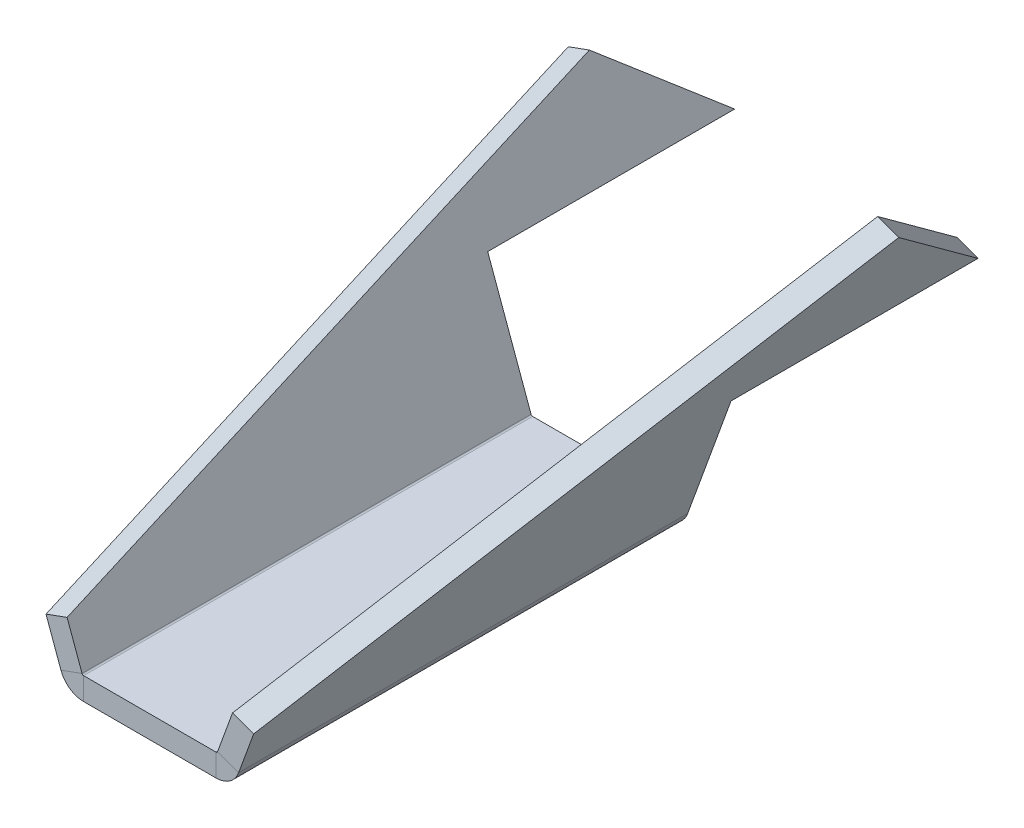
ISO-10303-21;
HEADER;
FILE_DESCRIPTION(('STEP AP214'),'2;1');
FILE_NAME('part.step','',(''),(''),'','','');
FILE_SCHEMA(('AUTOMOTIVE_DESIGN { 1 0 10303 214 1 1 1 1 }'));
ENDSEC;
DATA;
#1=APPLICATION_CONTEXT('core data for automotive mechanical design processes');
#2=APPLICATION_PROTOCOL_DEFINITION('international standard','automotive_design',2000,#1);
#3=PRODUCT_CONTEXT('',#1,'mechanical');
#4=PRODUCT('Part','Part','',(#3));
#5=PRODUCT_RELATED_PRODUCT_CATEGORY('part','',(#4));
#6=PRODUCT_DEFINITION_FORMATION('','',#4);
#7=PRODUCT_DEFINITION_CONTEXT('part definition',#1,'design');
#8=PRODUCT_DEFINITION('design','',#6,#7);
#9=PRODUCT_DEFINITION_SHAPE('','',#8);
#10=(LENGTH_UNIT() NAMED_UNIT(*) SI_UNIT(.MILLI.,.METRE.));
#11=(NAMED_UNIT(*) PLANE_ANGLE_UNIT() SI_UNIT($,.RADIAN.));
#12=(NAMED_UNIT(*) SI_UNIT($,.STERADIAN.) SOLID_ANGLE_UNIT());
#13=UNCERTAINTY_MEASURE_WITH_UNIT(LENGTH_MEASURE(1.E-05),#10,'distance_accuracy_value','');
#14=(GEOMETRIC_REPRESENTATION_CONTEXT(3) GLOBAL_UNCERTAINTY_ASSIGNED_CONTEXT((#13)) GLOBAL_UNIT_ASSIGNED_CONTEXT((#10,
#11,#12)) REPRESENTATION_CONTEXT('',''));
#15=CARTESIAN_POINT('',(0.,0.,0.));
#16=DIRECTION('',(0.,0.,1.));
#17=DIRECTION('',(1.,0.,0.));
#18=AXIS2_PLACEMENT_3D('',#15,#16,#17);
#19=CARTESIAN_POINT('',(-30.,-10.,200.));
#20=DIRECTION('',(0.,1.,0.));
#21=DIRECTION('',(0.,0.,1.));
#22=AXIS2_PLACEMENT_3D('',#19,#20,#21);
#23=PLANE('',#22);
#24=DIRECTION('',(0.,0.,-1.));
#25=VECTOR('',#24,1.);
#26=CARTESIAN_POINT('',(29.4842271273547,-10.,0.));
#27=LINE('',#26,#25);
#28=CARTESIAN_POINT('',(29.4842271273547,-10.,0.));
#29=VERTEX_POINT('',#28);
#30=CARTESIAN_POINT('',(29.4842271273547,-10.,200.));
#31=VERTEX_POINT('',#30);
#32=EDGE_CURVE('E251',#29,#31,#27,.F.);
#33=ORIENTED_EDGE('',*,*,#32,.T.);
#34=DIRECTION('',(1.,0.,0.));
#35=VECTOR('',#34,1.);
#36=CARTESIAN_POINT('',(-30.,-10.,200.));
#37=LINE('',#36,#35);
#38=CARTESIAN_POINT('',(-29.4842271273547,-10.,200.));
#39=VERTEX_POINT('',#38);
#40=EDGE_CURVE('E48',#39,#31,#37,.T.);
#41=ORIENTED_EDGE('',*,*,#40,.F.);
#42=DIRECTION('',(0.,0.,1.));
#43=VECTOR('',#42,1.);
#44=CARTESIAN_POINT('',(-29.4842271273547,-10.,200.));
#45=LINE('',#44,#43);
#46=CARTESIAN_POINT('',(-29.4842271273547,-10.,0.));
#47=VERTEX_POINT('',#46);
#48=EDGE_CURVE('E286',#39,#47,#45,.F.);
#49=ORIENTED_EDGE('',*,*,#48,.T.);
#50=DIRECTION('',(1.,0.,0.));
#51=VECTOR('',#50,1.);
#52=CARTESIAN_POINT('',(-30.,-10.,0.));
#53=LINE('',#52,#51);
#54=EDGE_CURVE('E303',#47,#29,#53,.T.);
#55=ORIENTED_EDGE('',*,*,#54,.T.);
#56=EDGE_LOOP('',(#33,#41,#49,#55));
#57=FACE_BOUND('',#56,.T.);
#58=ADVANCED_FACE('F41',(#57),#23,.F.);
#59=CARTESIAN_POINT('',(-30.,0.,200.));
#60=DIRECTION('',(0.,1.,0.));
#61=DIRECTION('',(0.,0.,1.));
#62=AXIS2_PLACEMENT_3D('',#59,#60,#61);
#63=PLANE('',#62);
#64=DIRECTION('',(1.,0.,0.));
#65=VECTOR('',#64,1.);
#66=CARTESIAN_POINT('',(-30.,0.,200.));
#67=LINE('',#66,#65);
#68=CARTESIAN_POINT('',(-29.4842271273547,0.,200.));
#69=VERTEX_POINT('',#68);
#70=CARTESIAN_POINT('',(29.4842271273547,0.,200.));
#71=VERTEX_POINT('',#70);
#72=EDGE_CURVE('E11',#69,#71,#67,.T.);
#73=ORIENTED_EDGE('',*,*,#72,.T.);
#74=DIRECTION('',(0.,0.,-1.));
#75=VECTOR('',#74,1.);
#76=CARTESIAN_POINT('',(29.4842271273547,0.,0.));
#77=LINE('',#76,#75);
#78=CARTESIAN_POINT('',(29.4842271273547,0.,0.));
#79=VERTEX_POINT('',#78);
#80=EDGE_CURVE('E263',#79,#71,#77,.F.);
#81=ORIENTED_EDGE('',*,*,#80,.F.);
#82=DIRECTION('',(1.,0.,0.));
#83=VECTOR('',#82,1.);
#84=CARTESIAN_POINT('',(-30.,0.,0.));
#85=LINE('',#84,#83);
#86=CARTESIAN_POINT('',(-29.4842271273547,0.,0.));
#87=VERTEX_POINT('',#86);
#88=EDGE_CURVE('E307',#87,#79,#85,.T.);
#89=ORIENTED_EDGE('',*,*,#88,.F.);
#90=DIRECTION('',(0.,0.,1.));
#91=VECTOR('',#90,1.);
#92=CARTESIAN_POINT('',(-29.4842271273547,0.,200.));
#93=LINE('',#92,#91);
#94=EDGE_CURVE('E54',#69,#87,#93,.F.);
#95=ORIENTED_EDGE('',*,*,#94,.F.);
#96=EDGE_LOOP('',(#73,#81,#89,#95));
#97=FACE_BOUND('',#96,.T.);
#98=ADVANCED_FACE('F355',(#97),#63,.T.);
#99=CARTESIAN_POINT('',(30.,-10.,200.));
#100=DIRECTION('',(0.,0.,-1.));
#101=DIRECTION('',(-1.,0.,0.));
#102=AXIS2_PLACEMENT_3D('',#99,#100,#101);
#103=PLANE('',#102);
#104=DIRECTION('',(0.,-1.,0.));
#105=VECTOR('',#104,1.);
#106=CARTESIAN_POINT('',(29.4842271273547,0.,200.));
#107=LINE('',#106,#105);
#108=EDGE_CURVE('E268',#71,#31,#107,.T.);
#109=ORIENTED_EDGE('',*,*,#108,.F.);
#110=ORIENTED_EDGE('',*,*,#72,.F.);
#111=DIRECTION('',(0.,-1.,0.));
#112=VECTOR('',#111,1.);
#113=CARTESIAN_POINT('',(-29.4842271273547,0.,200.));
#114=LINE('',#113,#112);
#115=EDGE_CURVE('E293',#69,#39,#114,.T.);
#116=ORIENTED_EDGE('',*,*,#115,.T.);
#117=ORIENTED_EDGE('',*,*,#40,.T.);
#118=EDGE_LOOP('',(#109,#110,#116,#117));
#119=FACE_BOUND('',#118,.T.);
#120=ADVANCED_FACE('F310',(#119),#103,.F.);
#121=CARTESIAN_POINT('',(30.,-10.,0.));
#122=DIRECTION('',(0.,0.,-1.));
#123=DIRECTION('',(-1.,0.,0.));
#124=AXIS2_PLACEMENT_3D('',#121,#122,#123);
#125=PLANE('',#124);
#126=ORIENTED_EDGE('',*,*,#88,.T.);
#127=DIRECTION('',(0.,-1.,0.));
#128=VECTOR('',#127,1.);
#129=CARTESIAN_POINT('',(29.4842271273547,0.,0.));
#130=LINE('',#129,#128);
#131=EDGE_CURVE('E257',#79,#29,#130,.T.);
#132=ORIENTED_EDGE('',*,*,#131,.T.);
#133=ORIENTED_EDGE('',*,*,#54,.F.);
#134=DIRECTION('',(0.,-1.,0.));
#135=VECTOR('',#134,1.);
#136=CARTESIAN_POINT('',(-29.4842271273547,0.,0.));
#137=LINE('',#136,#135);
#138=EDGE_CURVE('E62',#87,#47,#137,.T.);
#139=ORIENTED_EDGE('',*,*,#138,.F.);
#140=EDGE_LOOP('',(#126,#132,#133,#139));
#141=FACE_BOUND('',#140,.T.);
#142=ADVANCED_FACE('F354',(#141),#125,.T.);
#143=CARTESIAN_POINT('',(-29.4842271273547,0.736599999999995,0.));
#144=DIRECTION('',(0.,0.,-1.));
#145=DIRECTION('',(-1.,0.,0.));
#146=AXIS2_PLACEMENT_3D('',#143,#144,#145);
#147=PLANE('',#146);
#148=DIRECTION('',(-0.939692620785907,-0.342020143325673,0.));
#149=VECTOR('',#148,1.);
#150=CARTESIAN_POINT('',(-30.1764047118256,0.484667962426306,0.));
#151=LINE('',#150,#149);
#152=CARTESIAN_POINT('',(-30.1764047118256,0.484667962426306,0.));
#153=VERTEX_POINT('',#152);
#154=CARTESIAN_POINT('',(-39.5733309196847,-2.93553347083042,0.));
#155=VERTEX_POINT('',#154);
#156=EDGE_CURVE('E271',#153,#155,#151,.T.);
#157=ORIENTED_EDGE('',*,*,#156,.F.);
#158=CARTESIAN_POINT('',(-29.4842271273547,0.736599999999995,0.));
#159=DIRECTION('',(0.,0.,1.));
#160=DIRECTION('',(1.,0.,0.));
#161=AXIS2_PLACEMENT_3D('',#158,#159,#160);
#162=CIRCLE('',#161,0.736599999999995);
#163=EDGE_CURVE('E296',#87,#153,#162,.F.);
#164=ORIENTED_EDGE('',*,*,#163,.F.);
#165=ORIENTED_EDGE('',*,*,#138,.T.);
#166=CARTESIAN_POINT('',(-29.4842271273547,0.736599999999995,0.));
#167=DIRECTION('',(0.,0.,1.));
#168=DIRECTION('',(1.,0.,0.));
#169=AXIS2_PLACEMENT_3D('',#166,#167,#168);
#170=CIRCLE('',#169,10.7366);
#171=EDGE_CURVE('E289',#47,#155,#170,.F.);
#172=ORIENTED_EDGE('',*,*,#171,.T.);
#173=EDGE_LOOP('',(#157,#164,#165,#172));
#174=FACE_BOUND('',#173,.T.);
#175=ADVANCED_FACE('F361',(#174),#147,.T.);
#176=CARTESIAN_POINT('',(-29.4842271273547,0.736599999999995,200.));
#177=DIRECTION('',(0.,0.,-1.));
#178=DIRECTION('',(-1.,0.,0.));
#179=AXIS2_PLACEMENT_3D('',#176,#177,#178);
#180=PLANE('',#179);
#181=CARTESIAN_POINT('',(-29.4842271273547,0.736599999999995,200.));
#182=DIRECTION('',(0.,0.,1.));
#183=DIRECTION('',(1.,0.,0.));
#184=AXIS2_PLACEMENT_3D('',#181,#182,#183);
#185=CIRCLE('',#184,0.736599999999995);
#186=CARTESIAN_POINT('',(-30.1764047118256,0.484667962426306,200.));
#187=VERTEX_POINT('',#186);
#188=EDGE_CURVE('E175',#187,#69,#185,.T.);
#189=ORIENTED_EDGE('',*,*,#188,.F.);
#190=DIRECTION('',(-0.939692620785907,-0.342020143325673,0.));
#191=VECTOR('',#190,1.);
#192=CARTESIAN_POINT('',(-30.1764047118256,0.484667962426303,200.));
#193=LINE('',#192,#191);
#194=CARTESIAN_POINT('',(-39.5733309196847,-2.93553347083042,200.));
#195=VERTEX_POINT('',#194);
#196=EDGE_CURVE('E162',#187,#195,#193,.T.);
#197=ORIENTED_EDGE('',*,*,#196,.T.);
#198=CARTESIAN_POINT('',(-29.4842271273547,0.736599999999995,200.));
#199=DIRECTION('',(0.,0.,1.));
#200=DIRECTION('',(1.,0.,0.));
#201=AXIS2_PLACEMENT_3D('',#198,#199,#200);
#202=CIRCLE('',#201,10.7366);
#203=EDGE_CURVE('E290',#195,#39,#202,.T.);
#204=ORIENTED_EDGE('',*,*,#203,.T.);
#205=ORIENTED_EDGE('',*,*,#115,.F.);
#206=EDGE_LOOP('',(#189,#197,#204,#205));
#207=FACE_BOUND('',#206,.T.);
#208=ADVANCED_FACE('F390',(#207),#180,.F.);
#209=CARTESIAN_POINT('',(-29.4842271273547,0.736599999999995,200.));
#210=DIRECTION('',(0.,0.,1.));
#211=DIRECTION('',(-0.939692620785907,-0.342020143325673,0.));
#212=AXIS2_PLACEMENT_3D('',#209,#210,#211);
#213=CYLINDRICAL_SURFACE('',#212,10.7366);
#214=ORIENTED_EDGE('',*,*,#48,.F.);
#215=ORIENTED_EDGE('',*,*,#203,.F.);
#216=DIRECTION('',(0.,0.,-1.));
#217=VECTOR('',#216,1.);
#218=CARTESIAN_POINT('',(-39.5733309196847,-2.93553347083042,0.));
#219=LINE('',#218,#217);
#220=EDGE_CURVE('E167',#195,#155,#219,.T.);
#221=ORIENTED_EDGE('',*,*,#220,.T.);
#222=ORIENTED_EDGE('',*,*,#171,.F.);
#223=EDGE_LOOP('',(#214,#215,#221,#222));
#224=FACE_BOUND('',#223,.T.);
#225=ADVANCED_FACE('F388',(#224),#213,.T.);
#226=CARTESIAN_POINT('',(-29.4842271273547,0.736599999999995,200.));
#227=DIRECTION('',(0.,0.,1.));
#228=DIRECTION('',(-0.939692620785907,-0.342020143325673,0.));
#229=AXIS2_PLACEMENT_3D('',#226,#227,#228);
#230=CYLINDRICAL_SURFACE('',#229,0.736599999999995);
#231=ORIENTED_EDGE('',*,*,#94,.T.);
#232=ORIENTED_EDGE('',*,*,#163,.T.);
#233=DIRECTION('',(0.,0.,1.));
#234=VECTOR('',#233,1.);
#235=CARTESIAN_POINT('',(-30.1764047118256,0.484667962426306,0.));
#236=LINE('',#235,#234);
#237=EDGE_CURVE('E274',#153,#187,#236,.T.);
#238=ORIENTED_EDGE('',*,*,#237,.T.);
#239=ORIENTED_EDGE('',*,*,#188,.T.);
#240=EDGE_LOOP('',(#231,#232,#238,#239));
#241=FACE_BOUND('',#240,.T.);
#242=ADVANCED_FACE('F358',(#241),#230,.F.);
#243=CARTESIAN_POINT('',(-46.2373290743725,15.3736509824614,200.));
#244=DIRECTION('',(0.,0.,-1.));
#245=DIRECTION('',(-1.,0.,0.));
#246=AXIS2_PLACEMENT_3D('',#243,#244,#245);
#247=PLANE('',#246);
#248=ORIENTED_EDGE('',*,*,#196,.F.);
#249=DIRECTION('',(-0.342020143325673,0.939692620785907,0.));
#250=VECTOR('',#249,1.);
#251=CARTESIAN_POINT('',(-36.8404028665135,18.7938524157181,200.));
#252=LINE('',#251,#250);
#253=CARTESIAN_POINT('',(-36.8404028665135,18.7938524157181,200.));
#254=VERTEX_POINT('',#253);
#255=EDGE_CURVE('E155',#187,#254,#252,.T.);
#256=ORIENTED_EDGE('',*,*,#255,.T.);
#257=DIRECTION('',(0.939692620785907,0.342020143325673,0.));
#258=VECTOR('',#257,1.);
#259=CARTESIAN_POINT('',(-46.2373290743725,15.3736509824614,200.));
#260=LINE('',#259,#258);
#261=CARTESIAN_POINT('',(-46.2373290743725,15.3736509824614,200.));
#262=VERTEX_POINT('',#261);
#263=EDGE_CURVE('E159',#262,#254,#260,.T.);
#264=ORIENTED_EDGE('',*,*,#263,.F.);
#265=DIRECTION('',(-0.342020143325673,0.939692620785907,0.));
#266=VECTOR('',#265,1.);
#267=CARTESIAN_POINT('',(-46.2373290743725,15.3736509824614,200.));
#268=LINE('',#267,#266);
#269=EDGE_CURVE('E280',#195,#262,#268,.T.);
#270=ORIENTED_EDGE('',*,*,#269,.F.);
#271=EDGE_LOOP('',(#248,#256,#264,#270));
#272=FACE_BOUND('',#271,.T.);
#273=ADVANCED_FACE('F157',(#272),#247,.F.);
#274=CARTESIAN_POINT('',(-39.3969262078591,-3.42020143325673,0.));
#275=DIRECTION('',(0.,0.,1.));
#276=DIRECTION('',(1.,0.,0.));
#277=AXIS2_PLACEMENT_3D('',#274,#275,#276);
#278=PLANE('',#277);
#279=ORIENTED_EDGE('',*,*,#156,.T.);
#280=DIRECTION('',(0.342020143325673,-0.939692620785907,0.));
#281=VECTOR('',#280,1.);
#282=CARTESIAN_POINT('',(-39.3969262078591,-3.42020143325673,0.));
#283=LINE('',#282,#281);
#284=CARTESIAN_POINT('',(-58.8920743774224,50.14227795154,0.));
#285=VERTEX_POINT('',#284);
#286=EDGE_CURVE('E176',#285,#155,#283,.T.);
#287=ORIENTED_EDGE('',*,*,#286,.F.);
#288=DIRECTION('',(-0.939692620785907,-0.342020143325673,0.));
#289=VECTOR('',#288,1.);
#290=CARTESIAN_POINT('',(-49.4951481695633,53.5624793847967,0.));
#291=LINE('',#290,#289);
#292=CARTESIAN_POINT('',(-49.4951481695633,53.5624793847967,0.));
#293=VERTEX_POINT('',#292);
#294=EDGE_CURVE('E197',#293,#285,#291,.T.);
#295=ORIENTED_EDGE('',*,*,#294,.F.);
#296=DIRECTION('',(0.342020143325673,-0.939692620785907,0.));
#297=VECTOR('',#296,1.);
#298=CARTESIAN_POINT('',(-30.,0.,0.));
#299=LINE('',#298,#297);
#300=EDGE_CURVE('E166',#293,#153,#299,.T.);
#301=ORIENTED_EDGE('',*,*,#300,.T.);
#302=EDGE_LOOP('',(#279,#287,#295,#301));
#303=FACE_BOUND('',#302,.T.);
#304=ADVANCED_FACE('F364',(#303),#278,.F.);
#305=CARTESIAN_POINT('',(-39.3969262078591,-3.42020143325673,0.));
#306=DIRECTION('',(0.939692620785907,0.342020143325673,0.));
#307=DIRECTION('',(-0.342020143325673,0.939692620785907,0.));
#308=AXIS2_PLACEMENT_3D('',#305,#306,#307);
#309=PLANE('',#308);
#310=ORIENTED_EDGE('',*,*,#220,.F.);
#311=ORIENTED_EDGE('',*,*,#269,.T.);
#312=DIRECTION('',(-0.100583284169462,0.27635030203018,-0.95577900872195));
#313=VECTOR('',#312,1.);
#314=CARTESIAN_POINT('',(-46.2373290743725,15.3736509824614,200.));
#315=LINE('',#314,#313);
#316=CARTESIAN_POINT('',(-73.5989405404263,90.549060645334,-60.));
#317=VERTEX_POINT('',#316);
#318=EDGE_CURVE('E174',#262,#317,#315,.T.);
#319=ORIENTED_EDGE('',*,*,#318,.T.);
#320=DIRECTION('',(0.223010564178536,-0.612716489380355,-0.758185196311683));
#321=VECTOR('',#320,1.);
#322=CARTESIAN_POINT('',(-73.5989405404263,90.549060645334,-60.));
#323=LINE('',#322,#321);
#324=CARTESIAN_POINT('',(-58.8920743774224,50.14227795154,-110.));
#325=VERTEX_POINT('',#324);
#326=EDGE_CURVE('E188',#317,#325,#323,.T.);
#327=ORIENTED_EDGE('',*,*,#326,.T.);
#328=DIRECTION('',(0.,0.,1.));
#329=VECTOR('',#328,1.);
#330=CARTESIAN_POINT('',(-58.8920743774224,50.14227795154,-110.));
#331=LINE('',#330,#329);
#332=EDGE_CURVE('E183',#325,#285,#331,.T.);
#333=ORIENTED_EDGE('',*,*,#332,.T.);
#334=ORIENTED_EDGE('',*,*,#286,.T.);
#335=EDGE_LOOP('',(#310,#311,#319,#327,#333,#334));
#336=FACE_BOUND('',#335,.T.);
#337=ADVANCED_FACE('F368',(#336),#309,.F.);
#338=CARTESIAN_POINT('',(-30.,0.,0.));
#339=DIRECTION('',(0.939692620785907,0.342020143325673,0.));
#340=DIRECTION('',(-0.342020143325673,0.939692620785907,0.));
#341=AXIS2_PLACEMENT_3D('',#338,#339,#340);
#342=PLANE('',#341);
#343=ORIENTED_EDGE('',*,*,#255,.F.);
#344=ORIENTED_EDGE('',*,*,#237,.F.);
#345=ORIENTED_EDGE('',*,*,#300,.F.);
#346=DIRECTION('',(0.,0.,1.));
#347=VECTOR('',#346,1.);
#348=CARTESIAN_POINT('',(-49.4951481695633,53.5624793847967,-110.));
#349=LINE('',#348,#347);
#350=CARTESIAN_POINT('',(-49.4951481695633,53.5624793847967,-110.));
#351=VERTEX_POINT('',#350);
#352=EDGE_CURVE('E185',#351,#293,#349,.T.);
#353=ORIENTED_EDGE('',*,*,#352,.F.);
#354=DIRECTION('',(0.223010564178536,-0.612716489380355,-0.758185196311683));
#355=VECTOR('',#354,1.);
#356=CARTESIAN_POINT('',(-64.2020143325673,93.9692620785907,-60.));
#357=LINE('',#356,#355);
#358=CARTESIAN_POINT('',(-64.2020143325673,93.9692620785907,-60.));
#359=VERTEX_POINT('',#358);
#360=EDGE_CURVE('E182',#359,#351,#357,.T.);
#361=ORIENTED_EDGE('',*,*,#360,.F.);
#362=DIRECTION('',(-0.100583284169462,0.27635030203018,-0.95577900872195));
#363=VECTOR('',#362,1.);
#364=CARTESIAN_POINT('',(-36.8404028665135,18.7938524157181,200.));
#365=LINE('',#364,#363);
#366=EDGE_CURVE('E172',#254,#359,#365,.T.);
#367=ORIENTED_EDGE('',*,*,#366,.F.);
#368=EDGE_LOOP('',(#343,#344,#345,#353,#361,#367));
#369=FACE_BOUND('',#368,.T.);
#370=ADVANCED_FACE('F179',(#369),#342,.T.);
#371=CARTESIAN_POINT('',(29.4842271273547,0.736599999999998,200.));
#372=DIRECTION('',(0.,0.,1.));
#373=DIRECTION('',(1.,0.,0.));
#374=AXIS2_PLACEMENT_3D('',#371,#372,#373);
#375=PLANE('',#374);
#376=DIRECTION('',(0.939692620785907,-0.342020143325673,0.));
#377=VECTOR('',#376,1.);
#378=CARTESIAN_POINT('',(30.1764047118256,0.484667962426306,200.));
#379=LINE('',#378,#377);
#380=CARTESIAN_POINT('',(30.1764047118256,0.484667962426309,200.));
#381=VERTEX_POINT('',#380);
#382=CARTESIAN_POINT('',(39.5733309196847,-2.93553347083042,200.));
#383=VERTEX_POINT('',#382);
#384=EDGE_CURVE('E224',#381,#383,#379,.T.);
#385=ORIENTED_EDGE('',*,*,#384,.F.);
#386=CARTESIAN_POINT('',(29.4842271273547,0.736599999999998,200.));
#387=DIRECTION('',(0.,0.,-1.));
#388=DIRECTION('',(-1.,0.,0.));
#389=AXIS2_PLACEMENT_3D('',#386,#387,#388);
#390=CIRCLE('',#389,0.736599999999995);
#391=EDGE_CURVE('E260',#71,#381,#390,.F.);
#392=ORIENTED_EDGE('',*,*,#391,.F.);
#393=ORIENTED_EDGE('',*,*,#108,.T.);
#394=CARTESIAN_POINT('',(29.4842271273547,0.736599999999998,200.));
#395=DIRECTION('',(0.,0.,-1.));
#396=DIRECTION('',(-1.,0.,0.));
#397=AXIS2_PLACEMENT_3D('',#394,#395,#396);
#398=CIRCLE('',#397,10.7366);
#399=EDGE_CURVE('E253',#31,#383,#398,.F.);
#400=ORIENTED_EDGE('',*,*,#399,.T.);
#401=EDGE_LOOP('',(#385,#392,#393,#400));
#402=FACE_BOUND('',#401,.T.);
#403=ADVANCED_FACE('F317',(#402),#375,.T.);
#404=CARTESIAN_POINT('',(29.4842271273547,0.736599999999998,0.));
#405=DIRECTION('',(0.,0.,1.));
#406=DIRECTION('',(1.,0.,0.));
#407=AXIS2_PLACEMENT_3D('',#404,#405,#406);
#408=PLANE('',#407);
#409=CARTESIAN_POINT('',(29.4842271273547,0.736599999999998,0.));
#410=DIRECTION('',(0.,0.,-1.));
#411=DIRECTION('',(-1.,0.,0.));
#412=AXIS2_PLACEMENT_3D('',#409,#410,#411);
#413=CIRCLE('',#412,0.736599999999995);
#414=CARTESIAN_POINT('',(30.1764047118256,0.484667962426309,0.));
#415=VERTEX_POINT('',#414);
#416=EDGE_CURVE('E250',#415,#79,#413,.T.);
#417=ORIENTED_EDGE('',*,*,#416,.F.);
#418=DIRECTION('',(0.939692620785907,-0.342020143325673,0.));
#419=VECTOR('',#418,1.);
#420=CARTESIAN_POINT('',(30.1764047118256,0.48466796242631,0.));
#421=LINE('',#420,#419);
#422=CARTESIAN_POINT('',(39.5733309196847,-2.93553347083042,0.));
#423=VERTEX_POINT('',#422);
#424=EDGE_CURVE('E231',#415,#423,#421,.T.);
#425=ORIENTED_EDGE('',*,*,#424,.T.);
#426=CARTESIAN_POINT('',(29.4842271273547,0.736599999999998,0.));
#427=DIRECTION('',(0.,0.,-1.));
#428=DIRECTION('',(-1.,0.,0.));
#429=AXIS2_PLACEMENT_3D('',#426,#427,#428);
#430=CIRCLE('',#429,10.7366);
#431=EDGE_CURVE('E254',#423,#29,#430,.T.);
#432=ORIENTED_EDGE('',*,*,#431,.T.);
#433=ORIENTED_EDGE('',*,*,#131,.F.);
#434=EDGE_LOOP('',(#417,#425,#432,#433));
#435=FACE_BOUND('',#434,.T.);
#436=ADVANCED_FACE('F353',(#435),#408,.F.);
#437=CARTESIAN_POINT('',(29.4842271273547,0.736599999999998,0.));
#438=DIRECTION('',(0.,0.,-1.));
#439=DIRECTION('',(0.939692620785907,-0.342020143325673,0.));
#440=AXIS2_PLACEMENT_3D('',#437,#438,#439);
#441=CYLINDRICAL_SURFACE('',#440,10.7366);
#442=ORIENTED_EDGE('',*,*,#32,.F.);
#443=ORIENTED_EDGE('',*,*,#431,.F.);
#444=DIRECTION('',(0.,0.,1.));
#445=VECTOR('',#444,1.);
#446=CARTESIAN_POINT('',(39.5733309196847,-2.93553347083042,200.));
#447=LINE('',#446,#445);
#448=EDGE_CURVE('E234',#423,#383,#447,.T.);
#449=ORIENTED_EDGE('',*,*,#448,.T.);
#450=ORIENTED_EDGE('',*,*,#399,.F.);
#451=EDGE_LOOP('',(#442,#443,#449,#450));
#452=FACE_BOUND('',#451,.T.);
#453=ADVANCED_FACE('F320',(#452),#441,.T.);
#454=CARTESIAN_POINT('',(29.4842271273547,0.736599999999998,0.));
#455=DIRECTION('',(0.,0.,-1.));
#456=DIRECTION('',(0.939692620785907,-0.342020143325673,0.));
#457=AXIS2_PLACEMENT_3D('',#454,#455,#456);
#458=CYLINDRICAL_SURFACE('',#457,0.736599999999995);
#459=ORIENTED_EDGE('',*,*,#80,.T.);
#460=ORIENTED_EDGE('',*,*,#391,.T.);
#461=DIRECTION('',(0.,0.,-1.));
#462=VECTOR('',#461,1.);
#463=CARTESIAN_POINT('',(30.1764047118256,0.484667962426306,200.));
#464=LINE('',#463,#462);
#465=EDGE_CURVE('E229',#381,#415,#464,.T.);
#466=ORIENTED_EDGE('',*,*,#465,.T.);
#467=ORIENTED_EDGE('',*,*,#416,.T.);
#468=EDGE_LOOP('',(#459,#460,#466,#467));
#469=FACE_BOUND('',#468,.T.);
#470=ADVANCED_FACE('F350',(#469),#458,.F.);
#471=CARTESIAN_POINT('',(39.3969262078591,-3.42020143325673,200.));
#472=DIRECTION('',(0.,0.,-1.));
#473=DIRECTION('',(-1.,0.,0.));
#474=AXIS2_PLACEMENT_3D('',#471,#472,#473);
#475=PLANE('',#474);
#476=ORIENTED_EDGE('',*,*,#384,.T.);
#477=DIRECTION('',(-0.342020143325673,-0.939692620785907,0.));
#478=VECTOR('',#477,1.);
#479=CARTESIAN_POINT('',(39.3969262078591,-3.42020143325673,200.));
#480=LINE('',#479,#478);
#481=CARTESIAN_POINT('',(46.2373290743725,15.3736509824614,200.));
#482=VERTEX_POINT('',#481);
#483=EDGE_CURVE('E239',#482,#383,#480,.T.);
#484=ORIENTED_EDGE('',*,*,#483,.F.);
#485=DIRECTION('',(-0.939692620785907,0.342020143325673,0.));
#486=VECTOR('',#485,1.);
#487=CARTESIAN_POINT('',(46.2373290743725,15.3736509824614,200.));
#488=LINE('',#487,#486);
#489=CARTESIAN_POINT('',(36.8404028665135,18.7938524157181,200.));
#490=VERTEX_POINT('',#489);
#491=EDGE_CURVE('E245',#482,#490,#488,.T.);
#492=ORIENTED_EDGE('',*,*,#491,.T.);
#493=DIRECTION('',(-0.342020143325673,-0.939692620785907,0.));
#494=VECTOR('',#493,1.);
#495=CARTESIAN_POINT('',(30.,0.,200.));
#496=LINE('',#495,#494);
#497=EDGE_CURVE('E238',#490,#381,#496,.T.);
#498=ORIENTED_EDGE('',*,*,#497,.T.);
#499=EDGE_LOOP('',(#476,#484,#492,#498));
#500=FACE_BOUND('',#499,.T.);
#501=ADVANCED_FACE('F343',(#500),#475,.F.);
#502=CARTESIAN_POINT('',(46.2373290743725,15.3736509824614,0.));
#503=DIRECTION('',(0.,0.,1.));
#504=DIRECTION('',(1.,0.,0.));
#505=AXIS2_PLACEMENT_3D('',#502,#503,#504);
#506=PLANE('',#505);
#507=ORIENTED_EDGE('',*,*,#424,.F.);
#508=DIRECTION('',(0.342020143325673,0.939692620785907,0.));
#509=VECTOR('',#508,1.);
#510=CARTESIAN_POINT('',(36.8404028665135,18.7938524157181,0.));
#511=LINE('',#510,#509);
#512=CARTESIAN_POINT('',(49.4951481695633,53.5624793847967,0.));
#513=VERTEX_POINT('',#512);
#514=EDGE_CURVE('E243',#415,#513,#511,.T.);
#515=ORIENTED_EDGE('',*,*,#514,.T.);
#516=DIRECTION('',(0.939692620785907,-0.342020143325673,0.));
#517=VECTOR('',#516,1.);
#518=CARTESIAN_POINT('',(49.4951481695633,53.5624793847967,0.));
#519=LINE('',#518,#517);
#520=CARTESIAN_POINT('',(58.8920743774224,50.14227795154,0.));
#521=VERTEX_POINT('',#520);
#522=EDGE_CURVE('E214',#513,#521,#519,.T.);
#523=ORIENTED_EDGE('',*,*,#522,.T.);
#524=DIRECTION('',(0.342020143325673,0.939692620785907,0.));
#525=VECTOR('',#524,1.);
#526=CARTESIAN_POINT('',(46.2373290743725,15.3736509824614,0.));
#527=LINE('',#526,#525);
#528=EDGE_CURVE('E242',#423,#521,#527,.T.);
#529=ORIENTED_EDGE('',*,*,#528,.F.);
#530=EDGE_LOOP('',(#507,#515,#523,#529));
#531=FACE_BOUND('',#530,.T.);
#532=ADVANCED_FACE('F327',(#531),#506,.F.);
#533=CARTESIAN_POINT('',(46.2373290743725,15.3736509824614,200.));
#534=DIRECTION('',(-0.939692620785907,0.342020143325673,0.));
#535=DIRECTION('',(-0.342020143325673,-0.939692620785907,0.));
#536=AXIS2_PLACEMENT_3D('',#533,#534,#535);
#537=PLANE('',#536);
#538=ORIENTED_EDGE('',*,*,#448,.F.);
#539=ORIENTED_EDGE('',*,*,#528,.T.);
#540=DIRECTION('',(0.,0.,-1.));
#541=VECTOR('',#540,1.);
#542=CARTESIAN_POINT('',(58.8920743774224,50.14227795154,0.));
#543=LINE('',#542,#541);
#544=CARTESIAN_POINT('',(58.8920743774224,50.14227795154,-110.));
#545=VERTEX_POINT('',#544);
#546=EDGE_CURVE('E200',#521,#545,#543,.T.);
#547=ORIENTED_EDGE('',*,*,#546,.T.);
#548=DIRECTION('',(0.223010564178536,0.612716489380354,0.758185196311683));
#549=VECTOR('',#548,1.);
#550=CARTESIAN_POINT('',(73.5989405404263,90.549060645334,-60.));
#551=LINE('',#550,#549);
#552=CARTESIAN_POINT('',(73.5989405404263,90.549060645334,-60.));
#553=VERTEX_POINT('',#552);
#554=EDGE_CURVE('E217',#545,#553,#551,.T.);
#555=ORIENTED_EDGE('',*,*,#554,.T.);
#556=DIRECTION('',(-0.100583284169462,-0.27635030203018,0.95577900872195));
#557=VECTOR('',#556,1.);
#558=CARTESIAN_POINT('',(46.2373290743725,15.3736509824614,200.));
#559=LINE('',#558,#557);
#560=EDGE_CURVE('E208',#553,#482,#559,.T.);
#561=ORIENTED_EDGE('',*,*,#560,.T.);
#562=ORIENTED_EDGE('',*,*,#483,.T.);
#563=EDGE_LOOP('',(#538,#539,#547,#555,#561,#562));
#564=FACE_BOUND('',#563,.T.);
#565=ADVANCED_FACE('F324',(#564),#537,.F.);
#566=CARTESIAN_POINT('',(36.8404028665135,18.7938524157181,200.));
#567=DIRECTION('',(-0.939692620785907,0.342020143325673,0.));
#568=DIRECTION('',(-0.342020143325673,-0.939692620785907,0.));
#569=AXIS2_PLACEMENT_3D('',#566,#567,#568);
#570=PLANE('',#569);
#571=ORIENTED_EDGE('',*,*,#514,.F.);
#572=ORIENTED_EDGE('',*,*,#465,.F.);
#573=ORIENTED_EDGE('',*,*,#497,.F.);
#574=DIRECTION('',(-0.100583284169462,-0.27635030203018,0.95577900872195));
#575=VECTOR('',#574,1.);
#576=CARTESIAN_POINT('',(36.8404028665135,18.7938524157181,200.));
#577=LINE('',#576,#575);
#578=CARTESIAN_POINT('',(64.2020143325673,93.9692620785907,-60.));
#579=VERTEX_POINT('',#578);
#580=EDGE_CURVE('E211',#579,#490,#577,.T.);
#581=ORIENTED_EDGE('',*,*,#580,.F.);
#582=DIRECTION('',(0.223010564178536,0.612716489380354,0.758185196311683));
#583=VECTOR('',#582,1.);
#584=CARTESIAN_POINT('',(64.2020143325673,93.9692620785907,-60.));
#585=LINE('',#584,#583);
#586=CARTESIAN_POINT('',(49.4951481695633,53.5624793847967,-110.));
#587=VERTEX_POINT('',#586);
#588=EDGE_CURVE('E207',#587,#579,#585,.T.);
#589=ORIENTED_EDGE('',*,*,#588,.F.);
#590=DIRECTION('',(0.,0.,-1.));
#591=VECTOR('',#590,1.);
#592=CARTESIAN_POINT('',(49.4951481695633,53.5624793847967,0.));
#593=LINE('',#592,#591);
#594=EDGE_CURVE('E204',#513,#587,#593,.T.);
#595=ORIENTED_EDGE('',*,*,#594,.F.);
#596=EDGE_LOOP('',(#571,#572,#573,#581,#589,#595));
#597=FACE_BOUND('',#596,.T.);
#598=ADVANCED_FACE('F346',(#597),#570,.T.);
#599=CARTESIAN_POINT('',(36.8404028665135,18.7938524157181,200.));
#600=DIRECTION('',(0.326895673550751,0.898138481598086,0.294085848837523));
#601=DIRECTION('',(-0.939692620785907,0.342020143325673,0.));
#602=AXIS2_PLACEMENT_3D('',#599,#600,#601);
#603=PLANE('',#602);
#604=ORIENTED_EDGE('',*,*,#560,.F.);
#605=DIRECTION('',(0.939692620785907,-0.342020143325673,0.));
#606=VECTOR('',#605,1.);
#607=CARTESIAN_POINT('',(64.2020143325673,93.9692620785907,-60.));
#608=LINE('',#607,#606);
#609=EDGE_CURVE('E222',#579,#553,#608,.T.);
#610=ORIENTED_EDGE('',*,*,#609,.F.);
#611=ORIENTED_EDGE('',*,*,#580,.T.);
#612=ORIENTED_EDGE('',*,*,#491,.F.);
#613=EDGE_LOOP('',(#604,#610,#611,#612));
#614=FACE_BOUND('',#613,.T.);
#615=ADVANCED_FACE('F339',(#614),#603,.T.);
#616=CARTESIAN_POINT('',(64.2020143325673,93.9692620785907,-60.));
#617=DIRECTION('',(0.259314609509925,0.712461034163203,-0.652039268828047));
#618=DIRECTION('',(0.,0.675133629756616,0.737695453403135));
#619=AXIS2_PLACEMENT_3D('',#616,#617,#618);
#620=PLANE('',#619);
#621=ORIENTED_EDGE('',*,*,#554,.F.);
#622=DIRECTION('',(0.939692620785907,-0.342020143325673,0.));
#623=VECTOR('',#622,1.);
#624=CARTESIAN_POINT('',(49.4951481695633,53.5624793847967,-110.));
#625=LINE('',#624,#623);
#626=EDGE_CURVE('E225',#587,#545,#625,.T.);
#627=ORIENTED_EDGE('',*,*,#626,.F.);
#628=ORIENTED_EDGE('',*,*,#588,.T.);
#629=ORIENTED_EDGE('',*,*,#609,.T.);
#630=EDGE_LOOP('',(#621,#627,#628,#629));
#631=FACE_BOUND('',#630,.T.);
#632=ADVANCED_FACE('F431',(#631),#620,.T.);
#633=CARTESIAN_POINT('',(49.4951481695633,53.5624793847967,0.));
#634=DIRECTION('',(-0.342020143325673,-0.939692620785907,0.));
#635=DIRECTION('',(0.939692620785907,-0.342020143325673,0.));
#636=AXIS2_PLACEMENT_3D('',#633,#634,#635);
#637=PLANE('',#636);
#638=ORIENTED_EDGE('',*,*,#546,.F.);
#639=ORIENTED_EDGE('',*,*,#522,.F.);
#640=ORIENTED_EDGE('',*,*,#594,.T.);
#641=ORIENTED_EDGE('',*,*,#626,.T.);
#642=EDGE_LOOP('',(#638,#639,#640,#641));
#643=FACE_BOUND('',#642,.T.);
#644=ADVANCED_FACE('F333',(#643),#637,.T.);
#645=CARTESIAN_POINT('',(-49.4951481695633,53.5624793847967,-110.));
#646=DIRECTION('',(0.342020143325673,-0.939692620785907,0.));
#647=DIRECTION('',(0.939692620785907,0.342020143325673,0.));
#648=AXIS2_PLACEMENT_3D('',#645,#646,#647);
#649=PLANE('',#648);
#650=ORIENTED_EDGE('',*,*,#332,.F.);
#651=DIRECTION('',(-0.939692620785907,-0.342020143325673,0.));
#652=VECTOR('',#651,1.);
#653=CARTESIAN_POINT('',(-49.4951481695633,53.5624793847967,-110.));
#654=LINE('',#653,#652);
#655=EDGE_CURVE('E201',#351,#325,#654,.T.);
#656=ORIENTED_EDGE('',*,*,#655,.F.);
#657=ORIENTED_EDGE('',*,*,#352,.T.);
#658=ORIENTED_EDGE('',*,*,#294,.T.);
#659=EDGE_LOOP('',(#650,#656,#657,#658));
#660=FACE_BOUND('',#659,.T.);
#661=ADVANCED_FACE('F372',(#660),#649,.T.);
#662=CARTESIAN_POINT('',(-64.2020143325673,93.9692620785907,-60.));
#663=DIRECTION('',(-0.259314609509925,0.712461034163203,-0.652039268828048));
#664=DIRECTION('',(0.,0.675133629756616,0.737695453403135));
#665=AXIS2_PLACEMENT_3D('',#662,#663,#664);
#666=PLANE('',#665);
#667=ORIENTED_EDGE('',*,*,#326,.F.);
#668=DIRECTION('',(-0.939692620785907,-0.342020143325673,0.));
#669=VECTOR('',#668,1.);
#670=CARTESIAN_POINT('',(-64.2020143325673,93.9692620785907,-60.));
#671=LINE('',#670,#669);
#672=EDGE_CURVE('E193',#359,#317,#671,.T.);
#673=ORIENTED_EDGE('',*,*,#672,.F.);
#674=ORIENTED_EDGE('',*,*,#360,.T.);
#675=ORIENTED_EDGE('',*,*,#655,.T.);
#676=EDGE_LOOP('',(#667,#673,#674,#675));
#677=FACE_BOUND('',#676,.T.);
#678=ADVANCED_FACE('F374',(#677),#666,.T.);
#679=CARTESIAN_POINT('',(-36.8404028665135,18.7938524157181,200.));
#680=DIRECTION('',(-0.326895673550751,0.898138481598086,0.294085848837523));
#681=DIRECTION('',(-0.939692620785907,-0.342020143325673,0.));
#682=AXIS2_PLACEMENT_3D('',#679,#680,#681);
#683=PLANE('',#682);
#684=ORIENTED_EDGE('',*,*,#318,.F.);
#685=ORIENTED_EDGE('',*,*,#263,.T.);
#686=ORIENTED_EDGE('',*,*,#366,.T.);
#687=ORIENTED_EDGE('',*,*,#672,.T.);
#688=EDGE_LOOP('',(#684,#685,#686,#687));
#689=FACE_BOUND('',#688,.T.);
#690=ADVANCED_FACE('F171',(#689),#683,.T.);
#691=CLOSED_SHELL('',(#58,#98,#120,#142,#175,#208,#225,#242,#273,#304,#337,#370,#403,#436,#453,
#470,#501,#532,#565,#598,#615,#632,#644,#661,#678,#690));
#692=MANIFOLD_SOLID_BREP('B2',#691);
#693=ADVANCED_BREP_SHAPE_REPRESENTATION('',(#18,#692),#14);
#694=SHAPE_DEFINITION_REPRESENTATION(#9,#693);
ENDSEC;
END-ISO-10303-21;
